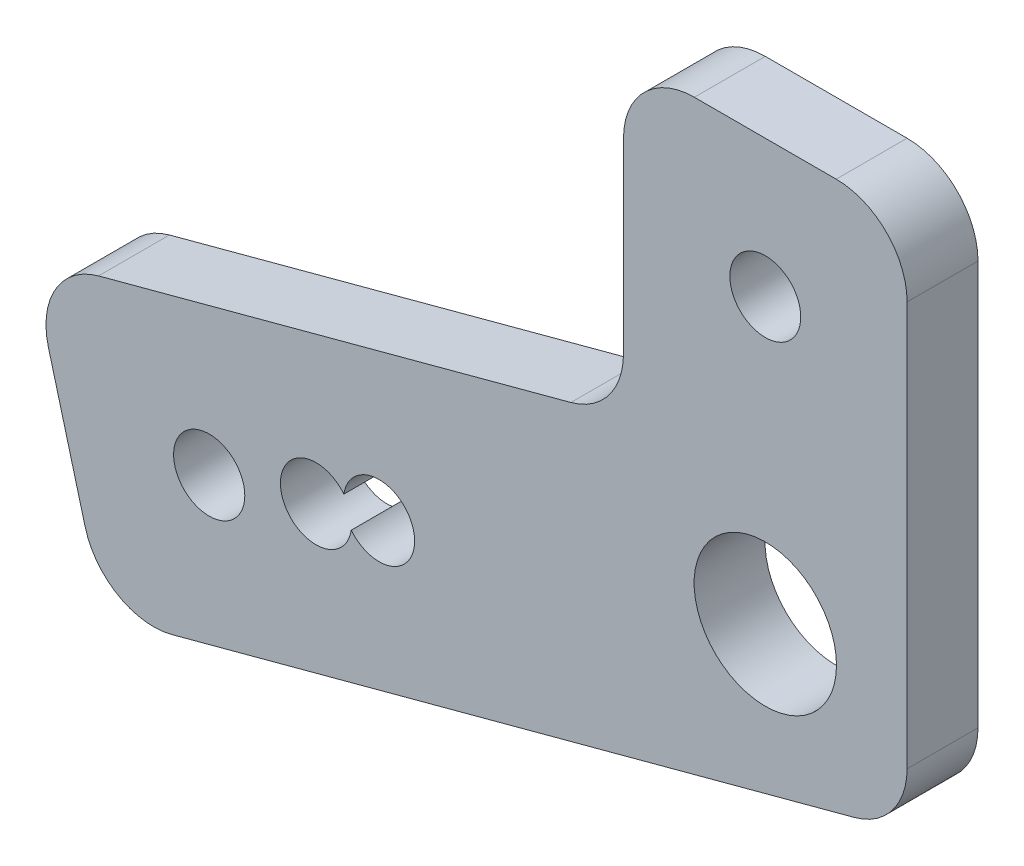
ISO-10303-21;
HEADER;
FILE_DESCRIPTION(('STEP AP214'),'2;1');
FILE_NAME('part.step','',(''),(''),'','','');
FILE_SCHEMA(('AUTOMOTIVE_DESIGN { 1 0 10303 214 1 1 1 1 }'));
ENDSEC;
DATA;
#1=APPLICATION_CONTEXT('core data for automotive mechanical design processes');
#2=APPLICATION_PROTOCOL_DEFINITION('international standard','automotive_design',2000,#1);
#3=PRODUCT_CONTEXT('',#1,'mechanical');
#4=PRODUCT('Part','Part','',(#3));
#5=PRODUCT_RELATED_PRODUCT_CATEGORY('part','',(#4));
#6=PRODUCT_DEFINITION_FORMATION('','',#4);
#7=PRODUCT_DEFINITION_CONTEXT('part definition',#1,'design');
#8=PRODUCT_DEFINITION('design','',#6,#7);
#9=PRODUCT_DEFINITION_SHAPE('','',#8);
#10=(LENGTH_UNIT() NAMED_UNIT(*) SI_UNIT(.MILLI.,.METRE.));
#11=(NAMED_UNIT(*) PLANE_ANGLE_UNIT() SI_UNIT($,.RADIAN.));
#12=(NAMED_UNIT(*) SI_UNIT($,.STERADIAN.) SOLID_ANGLE_UNIT());
#13=UNCERTAINTY_MEASURE_WITH_UNIT(LENGTH_MEASURE(1.E-05),#10,'distance_accuracy_value','');
#14=(GEOMETRIC_REPRESENTATION_CONTEXT(3) GLOBAL_UNCERTAINTY_ASSIGNED_CONTEXT((#13)) GLOBAL_UNIT_ASSIGNED_CONTEXT((#10,
#11,#12)) REPRESENTATION_CONTEXT('',''));
#15=CARTESIAN_POINT('',(0.,0.,0.));
#16=DIRECTION('',(0.,0.,1.));
#17=DIRECTION('',(1.,0.,0.));
#18=AXIS2_PLACEMENT_3D('',#15,#16,#17);
#19=CARTESIAN_POINT('',(0.,0.,6.35));
#20=DIRECTION('',(0.,0.,1.));
#21=DIRECTION('',(1.,0.,0.));
#22=AXIS2_PLACEMENT_3D('',#19,#20,#21);
#23=PLANE('',#22);
#24=CARTESIAN_POINT('',(-49.8050674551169,-13.3452276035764,6.35));
#25=DIRECTION('',(0.,0.,1.));
#26=DIRECTION('',(1.,0.,0.));
#27=AXIS2_PLACEMENT_3D('',#24,#25,#26);
#28=CIRCLE('',#27,3.1877);
#29=CARTESIAN_POINT('',(-46.6173674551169,-13.3452276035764,6.35));
#30=VERTEX_POINT('',#29);
#31=EDGE_CURVE('E160',#30,#30,#28,.T.);
#32=ORIENTED_EDGE('',*,*,#31,.F.);
#33=EDGE_LOOP('',(#32));
#34=FACE_BOUND('',#33,.T.);
#35=DIRECTION('',(-0.965925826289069,-0.258819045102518,0.));
#36=VECTOR('',#35,1.);
#37=CARTESIAN_POINT('',(-65.8500176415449,-4.4964515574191,6.35));
#38=LINE('',#37,#36);
#39=CARTESIAN_POINT('',(-17.406499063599,8.48395012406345,6.35));
#40=VERTEX_POINT('',#39);
#41=CARTESIAN_POINT('',(-59.7163886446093,-2.85295062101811,6.35));
#42=VERTEX_POINT('',#41);
#43=EDGE_CURVE('E170',#40,#42,#38,.T.);
#44=ORIENTED_EDGE('',*,*,#43,.T.);
#45=CARTESIAN_POINT('',(-58.0728877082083,-8.98657961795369,6.35));
#46=DIRECTION('',(0.,0.,1.));
#47=DIRECTION('',(1.,0.,0.));
#48=AXIS2_PLACEMENT_3D('',#45,#46,#47);
#49=CIRCLE('',#48,6.35);
#50=CARTESIAN_POINT('',(-64.2065167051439,-10.6300805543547,6.35));
#51=VERTEX_POINT('',#50);
#52=EDGE_CURVE('E229',#42,#51,#49,.T.);
#53=ORIENTED_EDGE('',*,*,#52,.T.);
#54=DIRECTION('',(0.258819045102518,-0.965925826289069,0.));
#55=VECTOR('',#54,1.);
#56=CARTESIAN_POINT('',(-59.276013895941,-29.0309675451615,6.35));
#57=LINE('',#56,#55);
#58=CARTESIAN_POINT('',(-60.919514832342,-22.8973385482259,6.35));
#59=VERTEX_POINT('',#58);
#60=EDGE_CURVE('E173',#51,#59,#57,.T.);
#61=ORIENTED_EDGE('',*,*,#60,.T.);
#62=CARTESIAN_POINT('',(-54.7858858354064,-21.2538376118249,6.35));
#63=DIRECTION('',(0.,0.,1.));
#64=DIRECTION('',(1.,0.,0.));
#65=AXIS2_PLACEMENT_3D('',#62,#63,#64);
#66=CIRCLE('',#65,6.35);
#67=CARTESIAN_POINT('',(-53.1423848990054,-27.3874666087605,6.35));
#68=VERTEX_POINT('',#67);
#69=EDGE_CURVE('E227',#59,#68,#66,.T.);
#70=ORIENTED_EDGE('',*,*,#69,.T.);
#71=DIRECTION('',(0.965925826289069,0.258819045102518,0.));
#72=VECTOR('',#71,1.);
#73=CARTESIAN_POINT('',(12.7,-9.74505274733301,6.35));
#74=LINE('',#73,#72);
#75=CARTESIAN_POINT('',(7.99350093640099,-11.0061553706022,6.35));
#76=VERTEX_POINT('',#75);
#77=EDGE_CURVE('E177',#68,#76,#74,.T.);
#78=ORIENTED_EDGE('',*,*,#77,.T.);
#79=CARTESIAN_POINT('',(6.35,-4.8725263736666,6.35));
#80=DIRECTION('',(0.,0.,1.));
#81=DIRECTION('',(1.,0.,0.));
#82=AXIS2_PLACEMENT_3D('',#79,#80,#81);
#83=CIRCLE('',#82,6.35);
#84=CARTESIAN_POINT('',(12.7,-4.8725263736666,6.35));
#85=VERTEX_POINT('',#84);
#86=EDGE_CURVE('E225',#76,#85,#83,.T.);
#87=ORIENTED_EDGE('',*,*,#86,.T.);
#88=DIRECTION('',(0.,1.,0.));
#89=VECTOR('',#88,1.);
#90=CARTESIAN_POINT('',(12.7,-9.74505274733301,6.35));
#91=LINE('',#90,#89);
#92=CARTESIAN_POINT('',(12.7,31.3350527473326,6.35));
#93=VERTEX_POINT('',#92);
#94=EDGE_CURVE('E180',#85,#93,#91,.T.);
#95=ORIENTED_EDGE('',*,*,#94,.T.);
#96=CARTESIAN_POINT('',(6.35,31.3350527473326,6.35));
#97=DIRECTION('',(0.,0.,1.));
#98=DIRECTION('',(1.,0.,0.));
#99=AXIS2_PLACEMENT_3D('',#96,#97,#98);
#100=CIRCLE('',#99,6.35);
#101=CARTESIAN_POINT('',(6.35,37.6850527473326,6.35));
#102=VERTEX_POINT('',#101);
#103=EDGE_CURVE('E223',#93,#102,#100,.T.);
#104=ORIENTED_EDGE('',*,*,#103,.T.);
#105=DIRECTION('',(-1.,0.,0.));
#106=VECTOR('',#105,1.);
#107=CARTESIAN_POINT('',(-12.7,37.6850527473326,6.35));
#108=LINE('',#107,#106);
#109=CARTESIAN_POINT('',(-6.35,37.6850527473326,6.35));
#110=VERTEX_POINT('',#109);
#111=EDGE_CURVE('E183',#102,#110,#108,.T.);
#112=ORIENTED_EDGE('',*,*,#111,.T.);
#113=CARTESIAN_POINT('',(-6.35,31.3350527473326,6.35));
#114=DIRECTION('',(0.,0.,1.));
#115=DIRECTION('',(1.,0.,0.));
#116=AXIS2_PLACEMENT_3D('',#113,#114,#115);
#117=CIRCLE('',#116,6.35);
#118=CARTESIAN_POINT('',(-12.7,31.3350527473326,6.35));
#119=VERTEX_POINT('',#118);
#120=EDGE_CURVE('E55',#110,#119,#117,.T.);
#121=ORIENTED_EDGE('',*,*,#120,.T.);
#122=DIRECTION('',(0.,-1.,0.));
#123=VECTOR('',#122,1.);
#124=CARTESIAN_POINT('',(-12.7,9.74505274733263,6.35));
#125=LINE('',#124,#123);
#126=CARTESIAN_POINT('',(-12.7,14.617579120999,6.35));
#127=VERTEX_POINT('',#126);
#128=EDGE_CURVE('E185',#119,#127,#125,.T.);
#129=ORIENTED_EDGE('',*,*,#128,.T.);
#130=CARTESIAN_POINT('',(-19.05,14.617579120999,6.35));
#131=DIRECTION('',(0.,0.,1.));
#132=DIRECTION('',(1.,0.,0.));
#133=AXIS2_PLACEMENT_3D('',#130,#131,#132);
#134=CIRCLE('',#133,6.35);
#135=EDGE_CURVE('E11',#127,#40,#134,.F.);
#136=ORIENTED_EDGE('',*,*,#135,.T.);
#137=EDGE_LOOP('',(#44,#53,#61,#70,#78,#87,#95,#104,#112,#121,#129,#136));
#138=FACE_BOUND('',#137,.T.);
#139=CARTESIAN_POINT('',(0.,0.,6.35));
#140=DIRECTION('',(0.,0.,1.));
#141=DIRECTION('',(1.,0.,0.));
#142=AXIS2_PLACEMENT_3D('',#139,#140,#141);
#143=CIRCLE('',#142,6.3754);
#144=CARTESIAN_POINT('',(6.3754,0.,6.35));
#145=VERTEX_POINT('',#144);
#146=EDGE_CURVE('E164',#145,#145,#143,.T.);
#147=ORIENTED_EDGE('',*,*,#146,.F.);
#148=EDGE_LOOP('',(#147));
#149=FACE_BOUND('',#148,.T.);
#150=CARTESIAN_POINT('',(-34.5936675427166,-9.26934528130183,6.35));
#151=DIRECTION('',(0.,0.,1.));
#152=DIRECTION('',(1.,0.,0.));
#153=AXIS2_PLACEMENT_3D('',#150,#151,#152);
#154=CIRCLE('',#153,3.1877);
#155=CARTESIAN_POINT('',(-37.0847809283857,-11.2582609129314,6.35));
#156=VERTEX_POINT('',#155);
#157=CARTESIAN_POINT('',(-37.7454928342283,-8.79245051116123,6.35));
#158=VERTEX_POINT('',#157);
#159=EDGE_CURVE('E135',#156,#158,#154,.T.);
#160=ORIENTED_EDGE('',*,*,#159,.F.);
#161=CARTESIAN_POINT('',(-40.2366062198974,-10.7813661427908,6.35));
#162=DIRECTION('',(0.,0.,1.));
#163=DIRECTION('',(1.,0.,0.));
#164=AXIS2_PLACEMENT_3D('',#161,#162,#163);
#165=CIRCLE('',#164,3.1877);
#166=EDGE_CURVE('E145',#158,#156,#165,.T.);
#167=ORIENTED_EDGE('',*,*,#166,.F.);
#168=EDGE_LOOP('',(#160,#167));
#169=FACE_BOUND('',#168,.T.);
#170=CARTESIAN_POINT('',(0.,25.4,6.35));
#171=DIRECTION('',(0.,0.,1.));
#172=DIRECTION('',(1.,0.,0.));
#173=AXIS2_PLACEMENT_3D('',#170,#171,#172);
#174=CIRCLE('',#173,3.175);
#175=CARTESIAN_POINT('',(3.175,25.4,6.35));
#176=VERTEX_POINT('',#175);
#177=EDGE_CURVE('E469',#176,#176,#174,.T.);
#178=ORIENTED_EDGE('',*,*,#177,.F.);
#179=EDGE_LOOP('',(#178));
#180=FACE_BOUND('',#179,.T.);
#181=ADVANCED_FACE('F33',(#34,#138,#149,#169,#180),#23,.T.);
#182=CARTESIAN_POINT('',(0.,0.,0.));
#183=DIRECTION('',(0.,0.,1.));
#184=DIRECTION('',(1.,0.,0.));
#185=AXIS2_PLACEMENT_3D('',#182,#183,#184);
#186=PLANE('',#185);
#187=CARTESIAN_POINT('',(0.,0.,0.));
#188=DIRECTION('',(0.,0.,1.));
#189=DIRECTION('',(1.,0.,0.));
#190=AXIS2_PLACEMENT_3D('',#187,#188,#189);
#191=CIRCLE('',#190,6.3754);
#192=CARTESIAN_POINT('',(6.3754,0.,0.));
#193=VERTEX_POINT('',#192);
#194=EDGE_CURVE('E163',#193,#193,#191,.T.);
#195=ORIENTED_EDGE('',*,*,#194,.T.);
#196=EDGE_LOOP('',(#195));
#197=FACE_BOUND('',#196,.T.);
#198=DIRECTION('',(0.258819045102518,-0.965925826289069,0.));
#199=VECTOR('',#198,1.);
#200=CARTESIAN_POINT('',(-59.276013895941,-29.0309675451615,0.));
#201=LINE('',#200,#199);
#202=CARTESIAN_POINT('',(-64.2065167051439,-10.6300805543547,0.));
#203=VERTEX_POINT('',#202);
#204=CARTESIAN_POINT('',(-60.919514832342,-22.8973385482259,0.));
#205=VERTEX_POINT('',#204);
#206=EDGE_CURVE('E190',#203,#205,#201,.T.);
#207=ORIENTED_EDGE('',*,*,#206,.F.);
#208=CARTESIAN_POINT('',(-58.0728877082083,-8.98657961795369,0.));
#209=DIRECTION('',(0.,0.,1.));
#210=DIRECTION('',(1.,0.,0.));
#211=AXIS2_PLACEMENT_3D('',#208,#209,#210);
#212=CIRCLE('',#211,6.35);
#213=CARTESIAN_POINT('',(-59.7163886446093,-2.85295062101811,0.));
#214=VERTEX_POINT('',#213);
#215=EDGE_CURVE('E215',#203,#214,#212,.F.);
#216=ORIENTED_EDGE('',*,*,#215,.T.);
#217=DIRECTION('',(-0.965925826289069,-0.258819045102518,0.));
#218=VECTOR('',#217,1.);
#219=CARTESIAN_POINT('',(-65.8500176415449,-4.4964515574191,0.));
#220=LINE('',#219,#218);
#221=CARTESIAN_POINT('',(-17.406499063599,8.48395012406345,0.));
#222=VERTEX_POINT('',#221);
#223=EDGE_CURVE('E167',#222,#214,#220,.T.);
#224=ORIENTED_EDGE('',*,*,#223,.F.);
#225=CARTESIAN_POINT('',(-19.05,14.617579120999,0.));
#226=DIRECTION('',(0.,0.,1.));
#227=DIRECTION('',(1.,0.,0.));
#228=AXIS2_PLACEMENT_3D('',#225,#226,#227);
#229=CIRCLE('',#228,6.35);
#230=CARTESIAN_POINT('',(-12.7,14.617579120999,0.));
#231=VERTEX_POINT('',#230);
#232=EDGE_CURVE('E41',#222,#231,#229,.T.);
#233=ORIENTED_EDGE('',*,*,#232,.T.);
#234=DIRECTION('',(0.,-1.,0.));
#235=VECTOR('',#234,1.);
#236=CARTESIAN_POINT('',(-12.7,9.74505274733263,0.));
#237=LINE('',#236,#235);
#238=CARTESIAN_POINT('',(-12.7,31.3350527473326,0.));
#239=VERTEX_POINT('',#238);
#240=EDGE_CURVE('E174',#239,#231,#237,.T.);
#241=ORIENTED_EDGE('',*,*,#240,.F.);
#242=CARTESIAN_POINT('',(-6.35,31.3350527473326,0.));
#243=DIRECTION('',(0.,0.,1.));
#244=DIRECTION('',(1.,0.,0.));
#245=AXIS2_PLACEMENT_3D('',#242,#243,#244);
#246=CIRCLE('',#245,6.35);
#247=CARTESIAN_POINT('',(-6.35,37.6850527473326,0.));
#248=VERTEX_POINT('',#247);
#249=EDGE_CURVE('E207',#239,#248,#246,.F.);
#250=ORIENTED_EDGE('',*,*,#249,.T.);
#251=DIRECTION('',(-1.,0.,0.));
#252=VECTOR('',#251,1.);
#253=CARTESIAN_POINT('',(-12.7,37.6850527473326,0.));
#254=LINE('',#253,#252);
#255=CARTESIAN_POINT('',(6.35,37.6850527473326,0.));
#256=VERTEX_POINT('',#255);
#257=EDGE_CURVE('E199',#256,#248,#254,.T.);
#258=ORIENTED_EDGE('',*,*,#257,.F.);
#259=CARTESIAN_POINT('',(6.35,31.3350527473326,0.));
#260=DIRECTION('',(0.,0.,1.));
#261=DIRECTION('',(1.,0.,0.));
#262=AXIS2_PLACEMENT_3D('',#259,#260,#261);
#263=CIRCLE('',#262,6.35);
#264=CARTESIAN_POINT('',(12.7,31.3350527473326,0.));
#265=VERTEX_POINT('',#264);
#266=EDGE_CURVE('E209',#256,#265,#263,.F.);
#267=ORIENTED_EDGE('',*,*,#266,.T.);
#268=DIRECTION('',(0.,1.,0.));
#269=VECTOR('',#268,1.);
#270=CARTESIAN_POINT('',(12.7,-9.74505274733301,0.));
#271=LINE('',#270,#269);
#272=CARTESIAN_POINT('',(12.7,-4.8725263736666,0.));
#273=VERTEX_POINT('',#272);
#274=EDGE_CURVE('E196',#273,#265,#271,.T.);
#275=ORIENTED_EDGE('',*,*,#274,.F.);
#276=CARTESIAN_POINT('',(6.35,-4.8725263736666,0.));
#277=DIRECTION('',(0.,0.,1.));
#278=DIRECTION('',(1.,0.,0.));
#279=AXIS2_PLACEMENT_3D('',#276,#277,#278);
#280=CIRCLE('',#279,6.35);
#281=CARTESIAN_POINT('',(7.99350093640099,-11.0061553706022,0.));
#282=VERTEX_POINT('',#281);
#283=EDGE_CURVE('E211',#273,#282,#280,.F.);
#284=ORIENTED_EDGE('',*,*,#283,.T.);
#285=DIRECTION('',(0.965925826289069,0.258819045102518,0.));
#286=VECTOR('',#285,1.);
#287=CARTESIAN_POINT('',(12.7,-9.74505274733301,0.));
#288=LINE('',#287,#286);
#289=CARTESIAN_POINT('',(-53.1423848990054,-27.3874666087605,0.));
#290=VERTEX_POINT('',#289);
#291=EDGE_CURVE('E193',#290,#282,#288,.T.);
#292=ORIENTED_EDGE('',*,*,#291,.F.);
#293=CARTESIAN_POINT('',(-54.7858858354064,-21.2538376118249,0.));
#294=DIRECTION('',(0.,0.,1.));
#295=DIRECTION('',(1.,0.,0.));
#296=AXIS2_PLACEMENT_3D('',#293,#294,#295);
#297=CIRCLE('',#296,6.35);
#298=EDGE_CURVE('E213',#290,#205,#297,.F.);
#299=ORIENTED_EDGE('',*,*,#298,.T.);
#300=EDGE_LOOP('',(#207,#216,#224,#233,#241,#250,#258,#267,#275,#284,#292,#299));
#301=FACE_BOUND('',#300,.T.);
#302=CARTESIAN_POINT('',(-40.2366062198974,-10.7813661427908,0.));
#303=DIRECTION('',(0.,0.,1.));
#304=DIRECTION('',(1.,0.,0.));
#305=AXIS2_PLACEMENT_3D('',#302,#303,#304);
#306=CIRCLE('',#305,3.1877);
#307=CARTESIAN_POINT('',(-37.7454928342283,-8.79245051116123,0.));
#308=VERTEX_POINT('',#307);
#309=CARTESIAN_POINT('',(-37.0847809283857,-11.2582609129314,0.));
#310=VERTEX_POINT('',#309);
#311=EDGE_CURVE('E150',#308,#310,#306,.T.);
#312=ORIENTED_EDGE('',*,*,#311,.T.);
#313=CARTESIAN_POINT('',(-34.5936675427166,-9.26934528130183,0.));
#314=DIRECTION('',(0.,0.,1.));
#315=DIRECTION('',(1.,0.,0.));
#316=AXIS2_PLACEMENT_3D('',#313,#314,#315);
#317=CIRCLE('',#316,3.1877);
#318=EDGE_CURVE('E153',#310,#308,#317,.T.);
#319=ORIENTED_EDGE('',*,*,#318,.T.);
#320=EDGE_LOOP('',(#312,#319));
#321=FACE_BOUND('',#320,.T.);
#322=CARTESIAN_POINT('',(-49.8050674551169,-13.3452276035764,0.));
#323=DIRECTION('',(0.,0.,1.));
#324=DIRECTION('',(1.,0.,0.));
#325=AXIS2_PLACEMENT_3D('',#322,#323,#324);
#326=CIRCLE('',#325,3.1877);
#327=CARTESIAN_POINT('',(-46.6173674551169,-13.3452276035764,0.));
#328=VERTEX_POINT('',#327);
#329=EDGE_CURVE('E157',#328,#328,#326,.T.);
#330=ORIENTED_EDGE('',*,*,#329,.T.);
#331=EDGE_LOOP('',(#330));
#332=FACE_BOUND('',#331,.T.);
#333=CARTESIAN_POINT('',(0.,25.4,0.));
#334=DIRECTION('',(0.,0.,1.));
#335=DIRECTION('',(1.,0.,0.));
#336=AXIS2_PLACEMENT_3D('',#333,#334,#335);
#337=CIRCLE('',#336,3.175);
#338=CARTESIAN_POINT('',(3.175,25.4,0.));
#339=VERTEX_POINT('',#338);
#340=EDGE_CURVE('E471',#339,#339,#337,.T.);
#341=ORIENTED_EDGE('',*,*,#340,.T.);
#342=EDGE_LOOP('',(#341));
#343=FACE_BOUND('',#342,.T.);
#344=ADVANCED_FACE('F253',(#197,#301,#321,#332,#343),#186,.F.);
#345=CARTESIAN_POINT('',(-65.8500176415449,-4.4964515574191,6.35));
#346=DIRECTION('',(0.258819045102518,-0.965925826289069,0.));
#347=DIRECTION('',(0.965925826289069,0.258819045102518,0.));
#348=AXIS2_PLACEMENT_3D('',#345,#346,#347);
#349=PLANE('',#348);
#350=ORIENTED_EDGE('',*,*,#223,.T.);
#351=DIRECTION('',(0.,0.,-1.));
#352=VECTOR('',#351,1.);
#353=CARTESIAN_POINT('',(-59.7163886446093,-2.85295062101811,6.35));
#354=LINE('',#353,#352);
#355=EDGE_CURVE('E220',#214,#42,#354,.F.);
#356=ORIENTED_EDGE('',*,*,#355,.T.);
#357=ORIENTED_EDGE('',*,*,#43,.F.);
#358=DIRECTION('',(0.,0.,-1.));
#359=VECTOR('',#358,1.);
#360=CARTESIAN_POINT('',(-17.406499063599,8.48395012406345,0.));
#361=LINE('',#360,#359);
#362=EDGE_CURVE('E217',#40,#222,#361,.T.);
#363=ORIENTED_EDGE('',*,*,#362,.T.);
#364=EDGE_LOOP('',(#350,#356,#357,#363));
#365=FACE_BOUND('',#364,.T.);
#366=ADVANCED_FACE('F264',(#365),#349,.F.);
#367=CARTESIAN_POINT('',(-59.276013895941,-29.0309675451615,6.35));
#368=DIRECTION('',(0.965925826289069,0.258819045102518,0.));
#369=DIRECTION('',(-0.258819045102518,0.965925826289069,0.));
#370=AXIS2_PLACEMENT_3D('',#367,#368,#369);
#371=PLANE('',#370);
#372=ORIENTED_EDGE('',*,*,#60,.F.);
#373=DIRECTION('',(0.,0.,-1.));
#374=VECTOR('',#373,1.);
#375=CARTESIAN_POINT('',(-64.2065167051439,-10.6300805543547,6.35));
#376=LINE('',#375,#374);
#377=EDGE_CURVE('E204',#51,#203,#376,.T.);
#378=ORIENTED_EDGE('',*,*,#377,.T.);
#379=ORIENTED_EDGE('',*,*,#206,.T.);
#380=DIRECTION('',(0.,0.,-1.));
#381=VECTOR('',#380,1.);
#382=CARTESIAN_POINT('',(-60.919514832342,-22.8973385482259,6.35));
#383=LINE('',#382,#381);
#384=EDGE_CURVE('E187',#205,#59,#383,.F.);
#385=ORIENTED_EDGE('',*,*,#384,.T.);
#386=EDGE_LOOP('',(#372,#378,#379,#385));
#387=FACE_BOUND('',#386,.T.);
#388=ADVANCED_FACE('F272',(#387),#371,.F.);
#389=CARTESIAN_POINT('',(12.7,-9.74505274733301,6.35));
#390=DIRECTION('',(-0.258819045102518,0.965925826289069,0.));
#391=DIRECTION('',(-0.965925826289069,-0.258819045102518,0.));
#392=AXIS2_PLACEMENT_3D('',#389,#390,#391);
#393=PLANE('',#392);
#394=ORIENTED_EDGE('',*,*,#77,.F.);
#395=DIRECTION('',(0.,0.,-1.));
#396=VECTOR('',#395,1.);
#397=CARTESIAN_POINT('',(-53.1423848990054,-27.3874666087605,6.35));
#398=LINE('',#397,#396);
#399=EDGE_CURVE('E233',#68,#290,#398,.T.);
#400=ORIENTED_EDGE('',*,*,#399,.T.);
#401=ORIENTED_EDGE('',*,*,#291,.T.);
#402=DIRECTION('',(0.,0.,-1.));
#403=VECTOR('',#402,1.);
#404=CARTESIAN_POINT('',(7.99350093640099,-11.0061553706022,6.35));
#405=LINE('',#404,#403);
#406=EDGE_CURVE('E231',#282,#76,#405,.F.);
#407=ORIENTED_EDGE('',*,*,#406,.T.);
#408=EDGE_LOOP('',(#394,#400,#401,#407));
#409=FACE_BOUND('',#408,.T.);
#410=ADVANCED_FACE('F280',(#409),#393,.F.);
#411=CARTESIAN_POINT('',(12.7,-9.74505274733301,6.35));
#412=DIRECTION('',(-1.,0.,0.));
#413=DIRECTION('',(0.,-1.,0.));
#414=AXIS2_PLACEMENT_3D('',#411,#412,#413);
#415=PLANE('',#414);
#416=ORIENTED_EDGE('',*,*,#94,.F.);
#417=DIRECTION('',(0.,0.,-1.));
#418=VECTOR('',#417,1.);
#419=CARTESIAN_POINT('',(12.7,-4.8725263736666,6.35));
#420=LINE('',#419,#418);
#421=EDGE_CURVE('E238',#85,#273,#420,.T.);
#422=ORIENTED_EDGE('',*,*,#421,.T.);
#423=ORIENTED_EDGE('',*,*,#274,.T.);
#424=DIRECTION('',(0.,0.,-1.));
#425=VECTOR('',#424,1.);
#426=CARTESIAN_POINT('',(12.7,31.3350527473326,6.35));
#427=LINE('',#426,#425);
#428=EDGE_CURVE('E236',#265,#93,#427,.F.);
#429=ORIENTED_EDGE('',*,*,#428,.T.);
#430=EDGE_LOOP('',(#416,#422,#423,#429));
#431=FACE_BOUND('',#430,.T.);
#432=ADVANCED_FACE('F289',(#431),#415,.F.);
#433=CARTESIAN_POINT('',(-12.7,37.6850527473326,6.35));
#434=DIRECTION('',(0.,-1.,0.));
#435=DIRECTION('',(0.,0.,-1.));
#436=AXIS2_PLACEMENT_3D('',#433,#434,#435);
#437=PLANE('',#436);
#438=ORIENTED_EDGE('',*,*,#111,.F.);
#439=DIRECTION('',(0.,0.,-1.));
#440=VECTOR('',#439,1.);
#441=CARTESIAN_POINT('',(6.35,37.6850527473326,6.35));
#442=LINE('',#441,#440);
#443=EDGE_CURVE('E243',#102,#256,#442,.T.);
#444=ORIENTED_EDGE('',*,*,#443,.T.);
#445=ORIENTED_EDGE('',*,*,#257,.T.);
#446=DIRECTION('',(0.,0.,-1.));
#447=VECTOR('',#446,1.);
#448=CARTESIAN_POINT('',(-6.35,37.6850527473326,6.35));
#449=LINE('',#448,#447);
#450=EDGE_CURVE('E241',#248,#110,#449,.F.);
#451=ORIENTED_EDGE('',*,*,#450,.T.);
#452=EDGE_LOOP('',(#438,#444,#445,#451));
#453=FACE_BOUND('',#452,.T.);
#454=ADVANCED_FACE('F297',(#453),#437,.F.);
#455=CARTESIAN_POINT('',(-12.7,9.74505274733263,6.35));
#456=DIRECTION('',(1.,0.,0.));
#457=DIRECTION('',(0.,0.,-1.));
#458=AXIS2_PLACEMENT_3D('',#455,#456,#457);
#459=PLANE('',#458);
#460=ORIENTED_EDGE('',*,*,#128,.F.);
#461=DIRECTION('',(0.,0.,-1.));
#462=VECTOR('',#461,1.);
#463=CARTESIAN_POINT('',(-12.7,31.3350527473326,6.35));
#464=LINE('',#463,#462);
#465=EDGE_CURVE('E247',#119,#239,#464,.T.);
#466=ORIENTED_EDGE('',*,*,#465,.T.);
#467=ORIENTED_EDGE('',*,*,#240,.T.);
#468=DIRECTION('',(0.,0.,-1.));
#469=VECTOR('',#468,1.);
#470=CARTESIAN_POINT('',(-12.7,14.617579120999,6.35));
#471=LINE('',#470,#469);
#472=EDGE_CURVE('E48',#231,#127,#471,.F.);
#473=ORIENTED_EDGE('',*,*,#472,.T.);
#474=EDGE_LOOP('',(#460,#466,#467,#473));
#475=FACE_BOUND('',#474,.T.);
#476=ADVANCED_FACE('F257',(#475),#459,.F.);
#477=CARTESIAN_POINT('',(0.,0.,6.35));
#478=DIRECTION('',(0.,0.,-1.));
#479=DIRECTION('',(-1.,0.,0.));
#480=AXIS2_PLACEMENT_3D('',#477,#478,#479);
#481=CYLINDRICAL_SURFACE('',#480,6.3754);
#482=ORIENTED_EDGE('',*,*,#146,.T.);
#483=EDGE_LOOP('',(#482));
#484=FACE_BOUND('',#483,.T.);
#485=ORIENTED_EDGE('',*,*,#194,.F.);
#486=EDGE_LOOP('',(#485));
#487=FACE_BOUND('',#486,.T.);
#488=ADVANCED_FACE('F319',(#484,#487),#481,.F.);
#489=CARTESIAN_POINT('',(-40.2366062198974,-10.7813661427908,6.35));
#490=DIRECTION('',(0.,0.,-1.));
#491=DIRECTION('',(-1.,0.,0.));
#492=AXIS2_PLACEMENT_3D('',#489,#490,#491);
#493=CYLINDRICAL_SURFACE('',#492,3.1877);
#494=ORIENTED_EDGE('',*,*,#311,.F.);
#495=DIRECTION('',(0.,0.,-1.));
#496=VECTOR('',#495,1.);
#497=CARTESIAN_POINT('',(-37.7454928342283,-8.79245051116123,6.35));
#498=LINE('',#497,#496);
#499=EDGE_CURVE('E138',#158,#308,#498,.T.);
#500=ORIENTED_EDGE('',*,*,#499,.F.);
#501=ORIENTED_EDGE('',*,*,#166,.T.);
#502=DIRECTION('',(0.,0.,-1.));
#503=VECTOR('',#502,1.);
#504=CARTESIAN_POINT('',(-37.0847809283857,-11.2582609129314,6.35));
#505=LINE('',#504,#503);
#506=EDGE_CURVE('E141',#156,#310,#505,.T.);
#507=ORIENTED_EDGE('',*,*,#506,.T.);
#508=EDGE_LOOP('',(#494,#500,#501,#507));
#509=FACE_BOUND('',#508,.T.);
#510=ADVANCED_FACE('F148',(#509),#493,.F.);
#511=CARTESIAN_POINT('',(-34.5936675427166,-9.26934528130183,6.35));
#512=DIRECTION('',(0.,0.,-1.));
#513=DIRECTION('',(-1.,0.,0.));
#514=AXIS2_PLACEMENT_3D('',#511,#512,#513);
#515=CYLINDRICAL_SURFACE('',#514,3.1877);
#516=ORIENTED_EDGE('',*,*,#318,.F.);
#517=ORIENTED_EDGE('',*,*,#506,.F.);
#518=ORIENTED_EDGE('',*,*,#159,.T.);
#519=ORIENTED_EDGE('',*,*,#499,.T.);
#520=EDGE_LOOP('',(#516,#517,#518,#519));
#521=FACE_BOUND('',#520,.T.);
#522=ADVANCED_FACE('F137',(#521),#515,.F.);
#523=CARTESIAN_POINT('',(-49.8050674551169,-13.3452276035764,6.35));
#524=DIRECTION('',(0.,0.,-1.));
#525=DIRECTION('',(-1.,0.,0.));
#526=AXIS2_PLACEMENT_3D('',#523,#524,#525);
#527=CYLINDRICAL_SURFACE('',#526,3.1877);
#528=ORIENTED_EDGE('',*,*,#31,.T.);
#529=EDGE_LOOP('',(#528));
#530=FACE_BOUND('',#529,.T.);
#531=ORIENTED_EDGE('',*,*,#329,.F.);
#532=EDGE_LOOP('',(#531));
#533=FACE_BOUND('',#532,.T.);
#534=ADVANCED_FACE('F378',(#530,#533),#527,.F.);
#535=CARTESIAN_POINT('',(0.,25.4,6.35));
#536=DIRECTION('',(0.,0.,-1.));
#537=DIRECTION('',(-1.,0.,0.));
#538=AXIS2_PLACEMENT_3D('',#535,#536,#537);
#539=CYLINDRICAL_SURFACE('',#538,3.175);
#540=ORIENTED_EDGE('',*,*,#177,.T.);
#541=EDGE_LOOP('',(#540));
#542=FACE_BOUND('',#541,.T.);
#543=ORIENTED_EDGE('',*,*,#340,.F.);
#544=EDGE_LOOP('',(#543));
#545=FACE_BOUND('',#544,.T.);
#546=ADVANCED_FACE('F336',(#542,#545),#539,.F.);
#547=CARTESIAN_POINT('',(-58.0728877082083,-8.98657961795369,6.35));
#548=DIRECTION('',(0.,0.,-1.));
#549=DIRECTION('',(-1.,0.,0.));
#550=AXIS2_PLACEMENT_3D('',#547,#548,#549);
#551=CYLINDRICAL_SURFACE('',#550,6.35);
#552=ORIENTED_EDGE('',*,*,#52,.F.);
#553=ORIENTED_EDGE('',*,*,#355,.F.);
#554=ORIENTED_EDGE('',*,*,#215,.F.);
#555=ORIENTED_EDGE('',*,*,#377,.F.);
#556=EDGE_LOOP('',(#552,#553,#554,#555));
#557=FACE_BOUND('',#556,.T.);
#558=ADVANCED_FACE('F267',(#557),#551,.T.);
#559=CARTESIAN_POINT('',(-54.7858858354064,-21.2538376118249,6.35));
#560=DIRECTION('',(0.,0.,-1.));
#561=DIRECTION('',(-1.,0.,0.));
#562=AXIS2_PLACEMENT_3D('',#559,#560,#561);
#563=CYLINDRICAL_SURFACE('',#562,6.35);
#564=ORIENTED_EDGE('',*,*,#69,.F.);
#565=ORIENTED_EDGE('',*,*,#384,.F.);
#566=ORIENTED_EDGE('',*,*,#298,.F.);
#567=ORIENTED_EDGE('',*,*,#399,.F.);
#568=EDGE_LOOP('',(#564,#565,#566,#567));
#569=FACE_BOUND('',#568,.T.);
#570=ADVANCED_FACE('F275',(#569),#563,.T.);
#571=CARTESIAN_POINT('',(6.35,-4.8725263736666,6.35));
#572=DIRECTION('',(0.,0.,-1.));
#573=DIRECTION('',(-1.,0.,0.));
#574=AXIS2_PLACEMENT_3D('',#571,#572,#573);
#575=CYLINDRICAL_SURFACE('',#574,6.35);
#576=ORIENTED_EDGE('',*,*,#86,.F.);
#577=ORIENTED_EDGE('',*,*,#406,.F.);
#578=ORIENTED_EDGE('',*,*,#283,.F.);
#579=ORIENTED_EDGE('',*,*,#421,.F.);
#580=EDGE_LOOP('',(#576,#577,#578,#579));
#581=FACE_BOUND('',#580,.T.);
#582=ADVANCED_FACE('F284',(#581),#575,.T.);
#583=CARTESIAN_POINT('',(6.35,31.3350527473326,6.35));
#584=DIRECTION('',(0.,0.,-1.));
#585=DIRECTION('',(-1.,0.,0.));
#586=AXIS2_PLACEMENT_3D('',#583,#584,#585);
#587=CYLINDRICAL_SURFACE('',#586,6.35);
#588=ORIENTED_EDGE('',*,*,#103,.F.);
#589=ORIENTED_EDGE('',*,*,#428,.F.);
#590=ORIENTED_EDGE('',*,*,#266,.F.);
#591=ORIENTED_EDGE('',*,*,#443,.F.);
#592=EDGE_LOOP('',(#588,#589,#590,#591));
#593=FACE_BOUND('',#592,.T.);
#594=ADVANCED_FACE('F293',(#593),#587,.T.);
#595=CARTESIAN_POINT('',(-6.35,31.3350527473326,6.35));
#596=DIRECTION('',(0.,0.,-1.));
#597=DIRECTION('',(-1.,0.,0.));
#598=AXIS2_PLACEMENT_3D('',#595,#596,#597);
#599=CYLINDRICAL_SURFACE('',#598,6.35);
#600=ORIENTED_EDGE('',*,*,#120,.F.);
#601=ORIENTED_EDGE('',*,*,#450,.F.);
#602=ORIENTED_EDGE('',*,*,#249,.F.);
#603=ORIENTED_EDGE('',*,*,#465,.F.);
#604=EDGE_LOOP('',(#600,#601,#602,#603));
#605=FACE_BOUND('',#604,.T.);
#606=ADVANCED_FACE('F301',(#605),#599,.T.);
#607=CARTESIAN_POINT('',(-19.05,14.617579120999,6.35));
#608=DIRECTION('',(0.,0.,1.));
#609=DIRECTION('',(1.,0.,0.));
#610=AXIS2_PLACEMENT_3D('',#607,#608,#609);
#611=CYLINDRICAL_SURFACE('',#610,6.35);
#612=ORIENTED_EDGE('',*,*,#135,.F.);
#613=ORIENTED_EDGE('',*,*,#472,.F.);
#614=ORIENTED_EDGE('',*,*,#232,.F.);
#615=ORIENTED_EDGE('',*,*,#362,.F.);
#616=EDGE_LOOP('',(#612,#613,#614,#615));
#617=FACE_BOUND('',#616,.T.);
#618=ADVANCED_FACE('F35',(#617),#611,.F.);
#619=CLOSED_SHELL('',(#181,#344,#366,#388,#410,#432,#454,#476,#488,#510,#522,#534,#546,#558,
#570,#582,#594,#606,#618));
#620=MANIFOLD_SOLID_BREP('B2',#619);
#621=ADVANCED_BREP_SHAPE_REPRESENTATION('',(#18,#620),#14);
#622=SHAPE_DEFINITION_REPRESENTATION(#9,#621);
ENDSEC;
END-ISO-10303-21;
